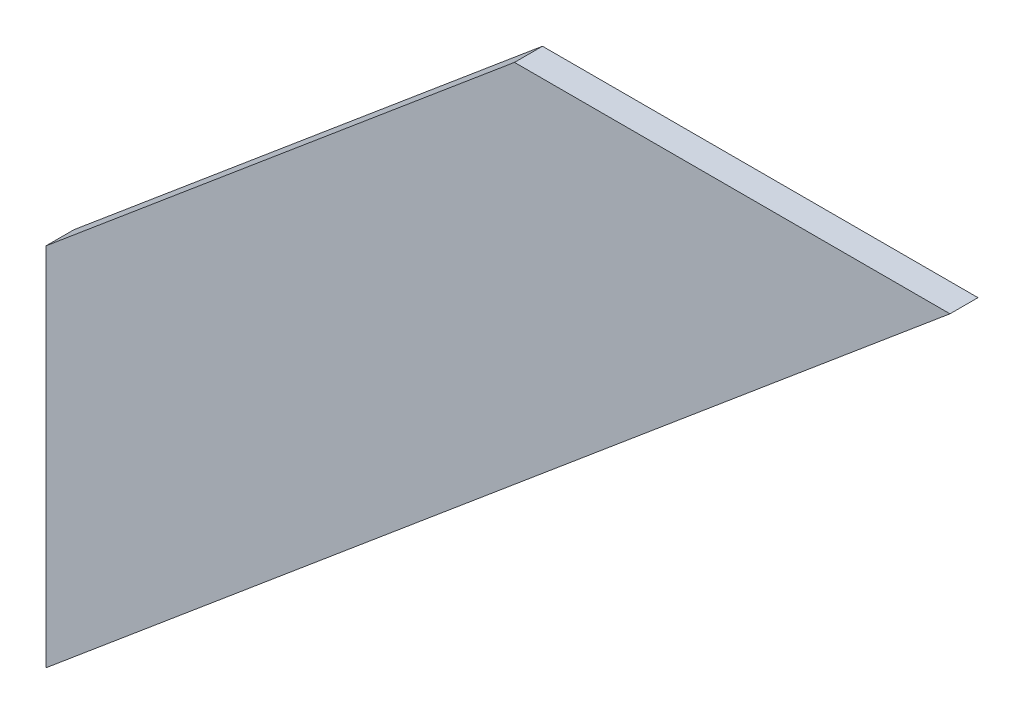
ISO-10303-21;
HEADER;
FILE_DESCRIPTION(('STEP AP214'),'2;1');
FILE_NAME('part.step','',(''),(''),'','','');
FILE_SCHEMA(('AUTOMOTIVE_DESIGN { 1 0 10303 214 1 1 1 1 }'));
ENDSEC;
DATA;
#1=APPLICATION_CONTEXT('core data for automotive mechanical design processes');
#2=APPLICATION_PROTOCOL_DEFINITION('international standard','automotive_design',2000,#1);
#3=PRODUCT_CONTEXT('',#1,'mechanical');
#4=PRODUCT('Part','Part','',(#3));
#5=PRODUCT_RELATED_PRODUCT_CATEGORY('part','',(#4));
#6=PRODUCT_DEFINITION_FORMATION('','',#4);
#7=PRODUCT_DEFINITION_CONTEXT('part definition',#1,'design');
#8=PRODUCT_DEFINITION('design','',#6,#7);
#9=PRODUCT_DEFINITION_SHAPE('','',#8);
#10=(LENGTH_UNIT() NAMED_UNIT(*) SI_UNIT(.MILLI.,.METRE.));
#11=(NAMED_UNIT(*) PLANE_ANGLE_UNIT() SI_UNIT($,.RADIAN.));
#12=(NAMED_UNIT(*) SI_UNIT($,.STERADIAN.) SOLID_ANGLE_UNIT());
#13=UNCERTAINTY_MEASURE_WITH_UNIT(LENGTH_MEASURE(1.E-05),#10,'distance_accuracy_value','');
#14=(GEOMETRIC_REPRESENTATION_CONTEXT(3) GLOBAL_UNCERTAINTY_ASSIGNED_CONTEXT((#13)) GLOBAL_UNIT_ASSIGNED_CONTEXT((#10,
#11,#12)) REPRESENTATION_CONTEXT('',''));
#15=CARTESIAN_POINT('',(0.,0.,0.));
#16=DIRECTION('',(0.,0.,1.));
#17=DIRECTION('',(1.,0.,0.));
#18=AXIS2_PLACEMENT_3D('',#15,#16,#17);
#19=CARTESIAN_POINT('',(-2520.,1057.66189628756,8.));
#20=DIRECTION('',(1.,0.,0.));
#21=DIRECTION('',(0.,0.,-1.));
#22=AXIS2_PLACEMENT_3D('',#19,#20,#21);
#23=PLANE('',#22);
#24=DIRECTION('',(0.,-1.,0.));
#25=VECTOR('',#24,1.);
#26=CARTESIAN_POINT('',(-2520.,1057.66189628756,0.));
#27=LINE('',#26,#25);
#28=CARTESIAN_POINT('',(-2520.,1057.66189628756,0.));
#29=VERTEX_POINT('',#28);
#30=CARTESIAN_POINT('',(-2520.,953.22931314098,0.));
#31=VERTEX_POINT('',#30);
#32=EDGE_CURVE('E94',#29,#31,#27,.T.);
#33=ORIENTED_EDGE('',*,*,#32,.T.);
#34=DIRECTION('',(0.,0.,-1.));
#35=VECTOR('',#34,1.);
#36=CARTESIAN_POINT('',(-2520.,953.22931314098,8.));
#37=LINE('',#36,#35);
#38=CARTESIAN_POINT('',(-2520.,953.22931314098,8.));
#39=VERTEX_POINT('',#38);
#40=EDGE_CURVE('E11',#39,#31,#37,.T.);
#41=ORIENTED_EDGE('',*,*,#40,.F.);
#42=DIRECTION('',(0.,-1.,0.));
#43=VECTOR('',#42,1.);
#44=CARTESIAN_POINT('',(-2520.,1057.66189628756,8.));
#45=LINE('',#44,#43);
#46=CARTESIAN_POINT('',(-2520.,1057.66189628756,8.));
#47=VERTEX_POINT('',#46);
#48=EDGE_CURVE('E82',#47,#39,#45,.T.);
#49=ORIENTED_EDGE('',*,*,#48,.F.);
#50=DIRECTION('',(0.,0.,-1.));
#51=VECTOR('',#50,1.);
#52=CARTESIAN_POINT('',(-2520.,1057.66189628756,8.));
#53=LINE('',#52,#51);
#54=EDGE_CURVE('E90',#47,#29,#53,.T.);
#55=ORIENTED_EDGE('',*,*,#54,.T.);
#56=EDGE_LOOP('',(#33,#41,#49,#55));
#57=FACE_BOUND('',#56,.T.);
#58=ADVANCED_FACE('F31',(#57),#23,.F.);
#59=CARTESIAN_POINT('',(-2261.66275516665,1170.,8.));
#60=DIRECTION('',(-0.642787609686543,0.766044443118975,0.));
#61=DIRECTION('',(-0.766044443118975,-0.642787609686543,0.));
#62=AXIS2_PLACEMENT_3D('',#59,#60,#61);
#63=PLANE('',#62);
#64=DIRECTION('',(0.766044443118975,0.642787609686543,0.));
#65=VECTOR('',#64,1.);
#66=CARTESIAN_POINT('',(-2261.66275516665,1170.,0.));
#67=LINE('',#66,#65);
#68=CARTESIAN_POINT('',(-2261.66275516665,1170.,0.));
#69=VERTEX_POINT('',#68);
#70=EDGE_CURVE('E86',#31,#69,#67,.T.);
#71=ORIENTED_EDGE('',*,*,#70,.T.);
#72=DIRECTION('',(0.,0.,-1.));
#73=VECTOR('',#72,1.);
#74=CARTESIAN_POINT('',(-2261.66275516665,1170.,8.));
#75=LINE('',#74,#73);
#76=CARTESIAN_POINT('',(-2261.66275516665,1170.,8.));
#77=VERTEX_POINT('',#76);
#78=EDGE_CURVE('E39',#77,#69,#75,.T.);
#79=ORIENTED_EDGE('',*,*,#78,.F.);
#80=DIRECTION('',(0.766044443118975,0.642787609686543,0.));
#81=VECTOR('',#80,1.);
#82=CARTESIAN_POINT('',(-2261.66275516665,1170.,8.));
#83=LINE('',#82,#81);
#84=EDGE_CURVE('E77',#39,#77,#83,.T.);
#85=ORIENTED_EDGE('',*,*,#84,.F.);
#86=ORIENTED_EDGE('',*,*,#40,.T.);
#87=EDGE_LOOP('',(#71,#79,#85,#86));
#88=FACE_BOUND('',#87,.T.);
#89=ADVANCED_FACE('F85',(#88),#63,.F.);
#90=CARTESIAN_POINT('',(-2386.12066131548,1170.,8.));
#91=DIRECTION('',(0.,-1.,0.));
#92=DIRECTION('',(0.,0.,-1.));
#93=AXIS2_PLACEMENT_3D('',#90,#91,#92);
#94=PLANE('',#93);
#95=DIRECTION('',(-1.,0.,0.));
#96=VECTOR('',#95,1.);
#97=CARTESIAN_POINT('',(-2386.12066131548,1170.,0.));
#98=LINE('',#97,#96);
#99=CARTESIAN_POINT('',(-2386.12066131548,1170.,0.));
#100=VERTEX_POINT('',#99);
#101=EDGE_CURVE('E64',#69,#100,#98,.T.);
#102=ORIENTED_EDGE('',*,*,#101,.T.);
#103=DIRECTION('',(0.,0.,-1.));
#104=VECTOR('',#103,1.);
#105=CARTESIAN_POINT('',(-2386.12066131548,1170.,8.));
#106=LINE('',#105,#104);
#107=CARTESIAN_POINT('',(-2386.12066131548,1170.,8.));
#108=VERTEX_POINT('',#107);
#109=EDGE_CURVE('E87',#108,#100,#106,.T.);
#110=ORIENTED_EDGE('',*,*,#109,.F.);
#111=DIRECTION('',(-1.,0.,0.));
#112=VECTOR('',#111,1.);
#113=CARTESIAN_POINT('',(-2386.12066131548,1170.,8.));
#114=LINE('',#113,#112);
#115=EDGE_CURVE('E80',#77,#108,#114,.T.);
#116=ORIENTED_EDGE('',*,*,#115,.F.);
#117=ORIENTED_EDGE('',*,*,#78,.T.);
#118=EDGE_LOOP('',(#102,#110,#116,#117));
#119=FACE_BOUND('',#118,.T.);
#120=ADVANCED_FACE('F88',(#119),#94,.F.);
#121=CARTESIAN_POINT('',(-2520.,1057.66189628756,8.));
#122=DIRECTION('',(0.642787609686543,-0.766044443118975,0.));
#123=DIRECTION('',(0.766044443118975,0.642787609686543,0.));
#124=AXIS2_PLACEMENT_3D('',#121,#122,#123);
#125=PLANE('',#124);
#126=DIRECTION('',(-0.766044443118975,-0.642787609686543,0.));
#127=VECTOR('',#126,1.);
#128=CARTESIAN_POINT('',(-2520.,1057.66189628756,0.));
#129=LINE('',#128,#127);
#130=EDGE_CURVE('E70',#100,#29,#129,.T.);
#131=ORIENTED_EDGE('',*,*,#130,.T.);
#132=ORIENTED_EDGE('',*,*,#54,.F.);
#133=DIRECTION('',(-0.766044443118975,-0.642787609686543,0.));
#134=VECTOR('',#133,1.);
#135=CARTESIAN_POINT('',(-2520.,1057.66189628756,8.));
#136=LINE('',#135,#134);
#137=EDGE_CURVE('E47',#108,#47,#136,.T.);
#138=ORIENTED_EDGE('',*,*,#137,.F.);
#139=ORIENTED_EDGE('',*,*,#109,.T.);
#140=EDGE_LOOP('',(#131,#132,#138,#139));
#141=FACE_BOUND('',#140,.T.);
#142=ADVANCED_FACE('F101',(#141),#125,.F.);
#143=CARTESIAN_POINT('',(-2520.,1170.,8.));
#144=DIRECTION('',(0.,0.,1.));
#145=DIRECTION('',(1.,0.,0.));
#146=AXIS2_PLACEMENT_3D('',#143,#144,#145);
#147=PLANE('',#146);
#148=ORIENTED_EDGE('',*,*,#48,.T.);
#149=ORIENTED_EDGE('',*,*,#84,.T.);
#150=ORIENTED_EDGE('',*,*,#115,.T.);
#151=ORIENTED_EDGE('',*,*,#137,.T.);
#152=EDGE_LOOP('',(#148,#149,#150,#151));
#153=FACE_BOUND('',#152,.T.);
#154=ADVANCED_FACE('F78',(#153),#147,.T.);
#155=CARTESIAN_POINT('',(-2520.,1170.,0.));
#156=DIRECTION('',(0.,0.,1.));
#157=DIRECTION('',(1.,0.,0.));
#158=AXIS2_PLACEMENT_3D('',#155,#156,#157);
#159=PLANE('',#158);
#160=ORIENTED_EDGE('',*,*,#32,.F.);
#161=ORIENTED_EDGE('',*,*,#130,.F.);
#162=ORIENTED_EDGE('',*,*,#101,.F.);
#163=ORIENTED_EDGE('',*,*,#70,.F.);
#164=EDGE_LOOP('',(#160,#161,#162,#163));
#165=FACE_BOUND('',#164,.T.);
#166=ADVANCED_FACE('F104',(#165),#159,.F.);
#167=CLOSED_SHELL('',(#58,#89,#120,#142,#154,#166));
#168=MANIFOLD_SOLID_BREP('B2',#167);
#169=ADVANCED_BREP_SHAPE_REPRESENTATION('',(#18,#168),#14);
#170=SHAPE_DEFINITION_REPRESENTATION(#9,#169);
ENDSEC;
END-ISO-10303-21;
